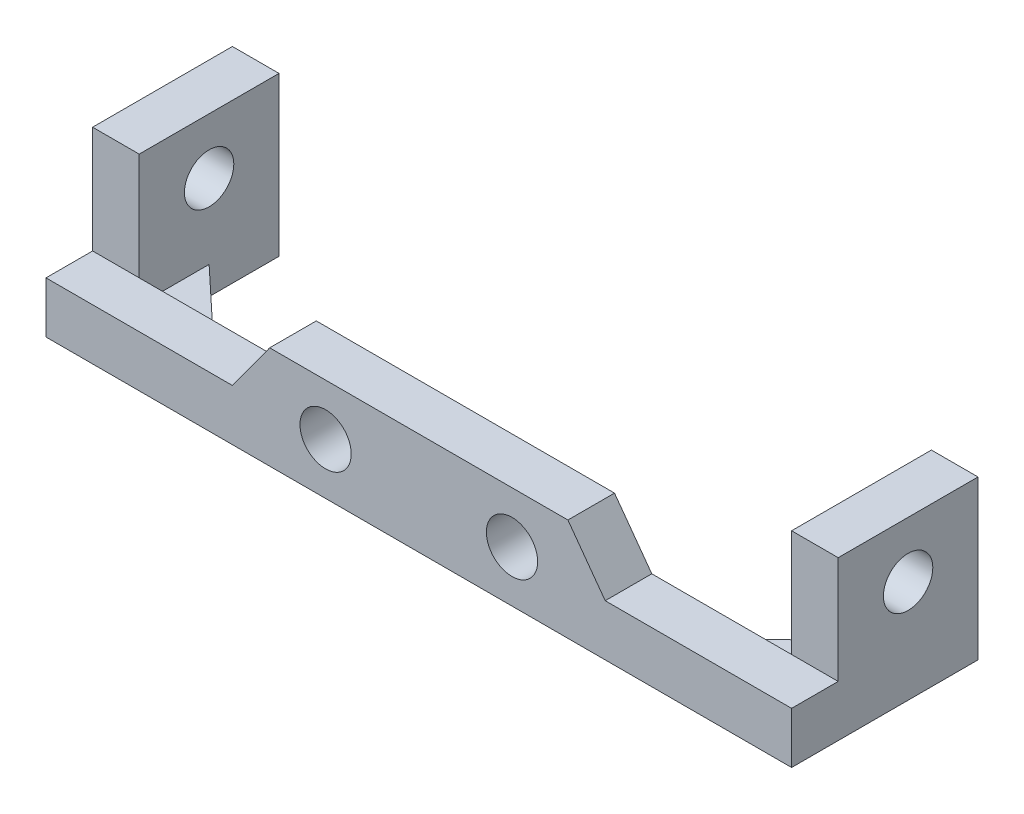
from build123d import *

# Parameters (mm, degrees)
ESBO_O1_W                = 80
ESBO_O1_H                = 5
RESSALTO_EXTRUS_O1_DEPTH = 11
ESBO_O2_R                = 2.75
CORTE_EXTRUS_O1_DEPTH    = 81.907354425
ESBO_O3_W                = 5
ESBO_O3_H                = 15
RESSALTO_EXTRUS_O2_DEPTH = 17
RESSALTO_EXTRUS_O3_DEPTH = 3
ESBO_O5_R                = 2.65
CORTE_EXTRUS_O2_DEPTH    = 85.196199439


with BuildPart() as part:
    # Esbo_o1 → Ressalto-extrus_o1 (new body)
    with BuildSketch(Plane(origin=(0, 0, 0), x_dir=(1, 0, 0), z_dir=(0, 1, 0))):
        with Locations((40, 2.5)):
            Rectangle(ESBO_O1_W, ESBO_O1_H)
    extrude(amount=RESSALTO_EXTRUS_O1_DEPTH)

    # Esbo_o2 → Corte-extrus_o1 (cut, through all)
    with BuildSketch(Plane.XY):
        Polygon((0, 5.5), (20, 5.5), (24, 11), (0, 11), align=None)
        with Locations((30, 5.5)):
            Circle(ESBO_O2_R)
        with Locations((50, 5.5)):
            Circle(ESBO_O2_R)
        Polygon((80, 11), (56, 11), (60, 5.5), (80, 5.5), align=None)
    extrude(amount=-CORTE_EXTRUS_O1_DEPTH, mode=Mode.SUBTRACT)

    # Esbo_o3 → Ressalto-extrus_o2 (add)
    with BuildSketch(Plane.XZ):
        with Locations((2.5, -12.5)):
            Rectangle(ESBO_O3_W, ESBO_O3_H)
        with Locations((77.5, -12.5)):
            Rectangle(ESBO_O3_W, ESBO_O3_H)
    extrude(amount=-RESSALTO_EXTRUS_O2_DEPTH)

    # Esbo_o4 → Ressalto-extrus_o3 (add)
    with BuildSketch(Plane.XZ):
        Polygon((5, -12.5), (13, -5), (5, -5), align=None)
        Polygon((67, -5), (75, -12.5), (75, -5), align=None)
    extrude(amount=-RESSALTO_EXTRUS_O3_DEPTH)

    # Esbo_o5 → Corte-extrus_o2 (cut, through all)
    with BuildSketch(Plane(origin=(80, 0, 0), x_dir=(0, 0, -1), z_dir=(1, 0, 0))):
        with Locations((12.5, 11)):
            Circle(ESBO_O5_R)
    extrude(amount=-CORTE_EXTRUS_O2_DEPTH, mode=Mode.SUBTRACT)


solid = part.part
